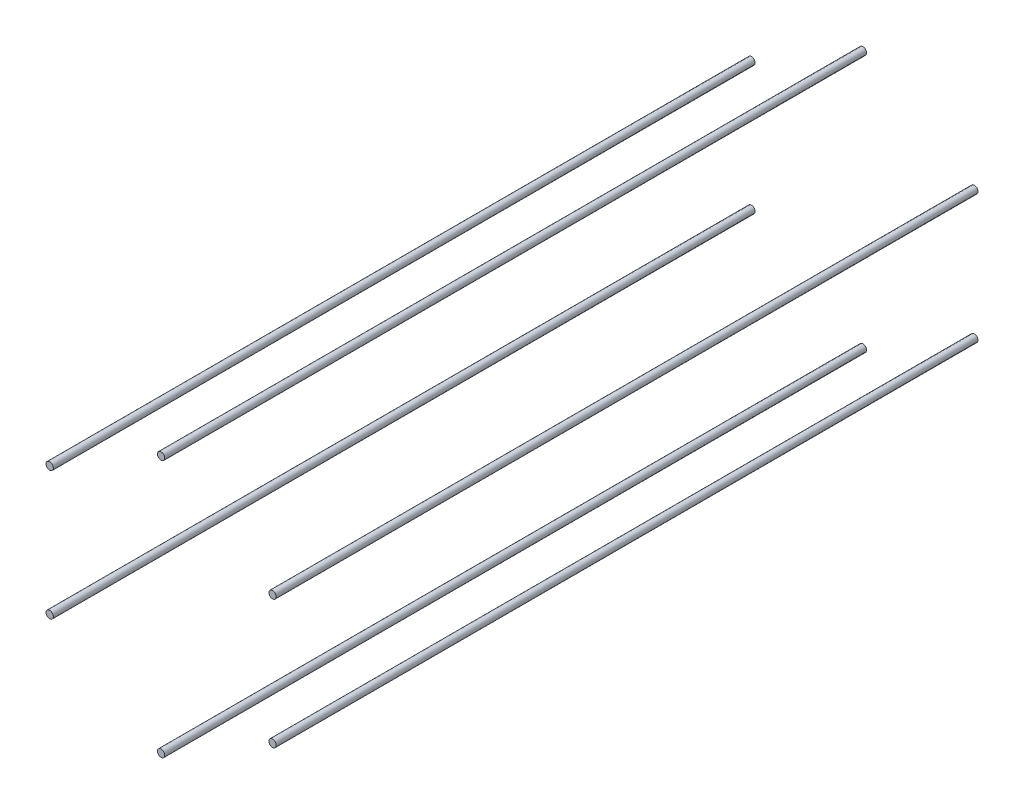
ISO-10303-21;
HEADER;
FILE_DESCRIPTION(('STEP AP214'),'2;1');
FILE_NAME('part.step','',(''),(''),'','','');
FILE_SCHEMA(('AUTOMOTIVE_DESIGN { 1 0 10303 214 1 1 1 1 }'));
ENDSEC;
DATA;
#1=APPLICATION_CONTEXT('core data for automotive mechanical design processes');
#2=APPLICATION_PROTOCOL_DEFINITION('international standard','automotive_design',2000,#1);
#3=PRODUCT_CONTEXT('',#1,'mechanical');
#4=PRODUCT('Part','Part','',(#3));
#5=PRODUCT_RELATED_PRODUCT_CATEGORY('part','',(#4));
#6=PRODUCT_DEFINITION_FORMATION('','',#4);
#7=PRODUCT_DEFINITION_CONTEXT('part definition',#1,'design');
#8=PRODUCT_DEFINITION('design','',#6,#7);
#9=PRODUCT_DEFINITION_SHAPE('','',#8);
#10=(LENGTH_UNIT() NAMED_UNIT(*) SI_UNIT(.MILLI.,.METRE.));
#11=(NAMED_UNIT(*) PLANE_ANGLE_UNIT() SI_UNIT($,.RADIAN.));
#12=(NAMED_UNIT(*) SI_UNIT($,.STERADIAN.) SOLID_ANGLE_UNIT());
#13=UNCERTAINTY_MEASURE_WITH_UNIT(LENGTH_MEASURE(1.E-05),#10,'distance_accuracy_value','');
#14=(GEOMETRIC_REPRESENTATION_CONTEXT(3) GLOBAL_UNCERTAINTY_ASSIGNED_CONTEXT((#13)) GLOBAL_UNIT_ASSIGNED_CONTEXT((#10,
#11,#12)) REPRESENTATION_CONTEXT('',''));
#15=CARTESIAN_POINT('',(0.,0.,0.));
#16=DIRECTION('',(0.,0.,1.));
#17=DIRECTION('',(1.,0.,0.));
#18=AXIS2_PLACEMENT_3D('',#15,#16,#17);
#19=CARTESIAN_POINT('',(-193.581536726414,111.764352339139,609.6));
#20=DIRECTION('',(0.,0.,-1.));
#21=DIRECTION('',(-1.,0.,0.));
#22=AXIS2_PLACEMENT_3D('',#19,#20,#21);
#23=CYLINDRICAL_SURFACE('',#22,6.34999999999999);
#24=CARTESIAN_POINT('',(-193.581536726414,111.764352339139,609.6));
#25=DIRECTION('',(0.,0.,1.));
#26=DIRECTION('',(1.,0.,0.));
#27=AXIS2_PLACEMENT_3D('',#24,#25,#26);
#28=CIRCLE('',#27,6.34999999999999);
#29=CARTESIAN_POINT('',(-199.931536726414,111.764352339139,609.6));
#30=VERTEX_POINT('',#29);
#31=EDGE_CURVE('E58',#30,#30,#28,.T.);
#32=CARTESIAN_POINT('',(-193.581536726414,111.764352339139,-609.6));
#33=DIRECTION('',(0.,0.,1.));
#34=DIRECTION('',(1.,0.,0.));
#35=AXIS2_PLACEMENT_3D('',#32,#33,#34);
#36=CIRCLE('',#35,6.34999999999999);
#37=CARTESIAN_POINT('',(-199.931536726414,111.764352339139,-609.6));
#38=VERTEX_POINT('',#37);
#39=EDGE_CURVE('E11',#38,#38,#36,.T.);
#40=CARTESIAN_POINT('',(-199.931536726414,111.764352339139,609.6));
#41=CARTESIAN_POINT('',(-199.931536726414,111.764352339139,596.9));
#42=CARTESIAN_POINT('',(-199.931536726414,111.764352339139,584.2));
#43=CARTESIAN_POINT('',(-199.931536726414,111.764352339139,558.8));
#44=CARTESIAN_POINT('',(-199.931536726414,111.764352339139,546.1));
#45=CARTESIAN_POINT('',(-199.931536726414,111.764352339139,520.7));
#46=CARTESIAN_POINT('',(-199.931536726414,111.764352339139,508.));
#47=CARTESIAN_POINT('',(-199.931536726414,111.764352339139,482.6));
#48=CARTESIAN_POINT('',(-199.931536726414,111.764352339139,469.9));
#49=CARTESIAN_POINT('',(-199.931536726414,111.764352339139,444.5));
#50=CARTESIAN_POINT('',(-199.931536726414,111.764352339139,431.8));
#51=CARTESIAN_POINT('',(-199.931536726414,111.764352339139,406.4));
#52=CARTESIAN_POINT('',(-199.931536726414,111.764352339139,393.7));
#53=CARTESIAN_POINT('',(-199.931536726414,111.764352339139,368.3));
#54=CARTESIAN_POINT('',(-199.931536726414,111.764352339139,355.6));
#55=CARTESIAN_POINT('',(-199.931536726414,111.764352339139,330.2));
#56=CARTESIAN_POINT('',(-199.931536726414,111.764352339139,317.5));
#57=CARTESIAN_POINT('',(-199.931536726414,111.764352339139,292.1));
#58=CARTESIAN_POINT('',(-199.931536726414,111.764352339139,279.4));
#59=CARTESIAN_POINT('',(-199.931536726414,111.764352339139,254.));
#60=CARTESIAN_POINT('',(-199.931536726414,111.764352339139,241.3));
#61=CARTESIAN_POINT('',(-199.931536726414,111.764352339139,215.9));
#62=CARTESIAN_POINT('',(-199.931536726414,111.764352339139,203.2));
#63=CARTESIAN_POINT('',(-199.931536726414,111.764352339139,177.8));
#64=CARTESIAN_POINT('',(-199.931536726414,111.764352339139,165.1));
#65=CARTESIAN_POINT('',(-199.931536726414,111.764352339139,139.7));
#66=CARTESIAN_POINT('',(-199.931536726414,111.764352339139,127.));
#67=CARTESIAN_POINT('',(-199.931536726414,111.764352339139,101.6));
#68=CARTESIAN_POINT('',(-199.931536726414,111.764352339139,88.9));
#69=CARTESIAN_POINT('',(-199.931536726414,111.764352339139,63.5));
#70=CARTESIAN_POINT('',(-199.931536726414,111.764352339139,50.8));
#71=CARTESIAN_POINT('',(-199.931536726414,111.764352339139,25.4));
#72=CARTESIAN_POINT('',(-199.931536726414,111.764352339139,12.7));
#73=CARTESIAN_POINT('',(-199.931536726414,111.764352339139,-12.7));
#74=CARTESIAN_POINT('',(-199.931536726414,111.764352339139,-25.4));
#75=CARTESIAN_POINT('',(-199.931536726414,111.764352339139,-50.8));
#76=CARTESIAN_POINT('',(-199.931536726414,111.764352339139,-63.5));
#77=CARTESIAN_POINT('',(-199.931536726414,111.764352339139,-88.9));
#78=CARTESIAN_POINT('',(-199.931536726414,111.764352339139,-101.6));
#79=CARTESIAN_POINT('',(-199.931536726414,111.764352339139,-127.));
#80=CARTESIAN_POINT('',(-199.931536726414,111.764352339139,-139.7));
#81=CARTESIAN_POINT('',(-199.931536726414,111.764352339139,-165.1));
#82=CARTESIAN_POINT('',(-199.931536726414,111.764352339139,-177.8));
#83=CARTESIAN_POINT('',(-199.931536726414,111.764352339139,-203.2));
#84=CARTESIAN_POINT('',(-199.931536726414,111.764352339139,-215.9));
#85=CARTESIAN_POINT('',(-199.931536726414,111.764352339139,-241.3));
#86=CARTESIAN_POINT('',(-199.931536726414,111.764352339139,-254.));
#87=CARTESIAN_POINT('',(-199.931536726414,111.764352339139,-279.4));
#88=CARTESIAN_POINT('',(-199.931536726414,111.764352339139,-292.1));
#89=CARTESIAN_POINT('',(-199.931536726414,111.764352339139,-317.5));
#90=CARTESIAN_POINT('',(-199.931536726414,111.764352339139,-330.2));
#91=CARTESIAN_POINT('',(-199.931536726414,111.764352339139,-355.6));
#92=CARTESIAN_POINT('',(-199.931536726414,111.764352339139,-368.3));
#93=CARTESIAN_POINT('',(-199.931536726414,111.764352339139,-393.7));
#94=CARTESIAN_POINT('',(-199.931536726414,111.764352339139,-406.4));
#95=CARTESIAN_POINT('',(-199.931536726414,111.764352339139,-431.8));
#96=CARTESIAN_POINT('',(-199.931536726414,111.764352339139,-444.5));
#97=CARTESIAN_POINT('',(-199.931536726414,111.764352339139,-469.9));
#98=CARTESIAN_POINT('',(-199.931536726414,111.764352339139,-482.6));
#99=CARTESIAN_POINT('',(-199.931536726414,111.764352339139,-508.));
#100=CARTESIAN_POINT('',(-199.931536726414,111.764352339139,-520.7));
#101=CARTESIAN_POINT('',(-199.931536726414,111.764352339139,-546.1));
#102=CARTESIAN_POINT('',(-199.931536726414,111.764352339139,-558.8));
#103=CARTESIAN_POINT('',(-199.931536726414,111.764352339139,-584.2));
#104=CARTESIAN_POINT('',(-199.931536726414,111.764352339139,-596.9));
#105=CARTESIAN_POINT('',(-199.931536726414,111.764352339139,-609.6));
#106=B_SPLINE_CURVE_WITH_KNOTS('',3,(#40,#41,#42,#43,#44,#45,#46,#47,#48,#49,#50,#51,#52,#53,
#54,#55,#56,#57,#58,#59,#60,#61,#62,#63,#64,#65,#66,#67,#68,#69,#70,#71,#72,#73,#74,#75,#76,#77,
#78,#79,#80,#81,#82,#83,#84,#85,#86,#87,#88,#89,#90,#91,#92,#93,#94,#95,#96,#97,#98,#99,#100,
#101,#102,#103,#104,#105),.UNSPECIFIED.,.F.,.F.,(4,2,2,2,2,2,2,2,2,2,2,2,2,2,2,2,2,2,2,2,2,2,2,
2,2,2,2,2,2,2,2,2,4),(0.,38.1,76.2,114.3,152.4,190.5,228.6,266.7,304.8,342.9,381.,419.1,457.2,
495.3,533.4,571.5,609.6,647.7,685.8,723.9,762.,800.1,838.2,876.3,914.4,952.5,990.6,1028.7,
1066.8,1104.9,1143.,1181.1,1219.2),.UNSPECIFIED.);
#107=EDGE_CURVE('BSEAM54',#30,#38,#106,.T.);
#108=ORIENTED_EDGE('',*,*,#31,.F.);
#109=ORIENTED_EDGE('',*,*,#39,.T.);
#110=ORIENTED_EDGE('',*,*,#107,.T.);
#111=ORIENTED_EDGE('',*,*,#107,.F.);
#112=EDGE_LOOP('',(#108,#110,#109,#111));
#113=FACE_BOUND('',#112,.T.);
#114=ADVANCED_FACE('F54',(#113),#23,.T.);
#115=CARTESIAN_POINT('',(-193.581536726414,111.764352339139,609.6));
#116=DIRECTION('',(0.,0.,1.));
#117=DIRECTION('',(1.,0.,0.));
#118=AXIS2_PLACEMENT_3D('',#115,#116,#117);
#119=PLANE('',#118);
#120=ORIENTED_EDGE('',*,*,#31,.T.);
#121=EDGE_LOOP('',(#120));
#122=FACE_BOUND('',#121,.T.);
#123=ADVANCED_FACE('F56',(#122),#119,.T.);
#124=CARTESIAN_POINT('',(-193.581536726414,111.764352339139,-609.6));
#125=DIRECTION('',(0.,0.,1.));
#126=DIRECTION('',(1.,0.,0.));
#127=AXIS2_PLACEMENT_3D('',#124,#125,#126);
#128=PLANE('',#127);
#129=ORIENTED_EDGE('',*,*,#39,.F.);
#130=EDGE_LOOP('',(#129));
#131=FACE_BOUND('',#130,.T.);
#132=ADVANCED_FACE('F73',(#131),#128,.F.);
#133=CLOSED_SHELL('',(#114,#123,#132));
#134=MANIFOLD_SOLID_BREP('B2',#133);
#135=CARTESIAN_POINT('',(-193.581536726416,-111.764352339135,609.6));
#136=DIRECTION('',(0.,0.,-1.));
#137=DIRECTION('',(-1.,0.,0.));
#138=AXIS2_PLACEMENT_3D('',#135,#136,#137);
#139=CYLINDRICAL_SURFACE('',#138,6.35);
#140=CARTESIAN_POINT('',(-193.581536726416,-111.764352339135,609.6));
#141=DIRECTION('',(0.,0.,1.));
#142=DIRECTION('',(1.,0.,0.));
#143=AXIS2_PLACEMENT_3D('',#140,#141,#142);
#144=CIRCLE('',#143,6.35);
#145=CARTESIAN_POINT('',(-199.931536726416,-111.764352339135,609.6));
#146=VERTEX_POINT('',#145);
#147=EDGE_CURVE('E107',#146,#146,#144,.T.);
#148=CARTESIAN_POINT('',(-193.581536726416,-111.764352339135,-609.6));
#149=DIRECTION('',(0.,0.,1.));
#150=DIRECTION('',(1.,0.,0.));
#151=AXIS2_PLACEMENT_3D('',#148,#149,#150);
#152=CIRCLE('',#151,6.35);
#153=CARTESIAN_POINT('',(-199.931536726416,-111.764352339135,-609.6));
#154=VERTEX_POINT('',#153);
#155=EDGE_CURVE('E53',#154,#154,#152,.T.);
#156=CARTESIAN_POINT('',(-199.931536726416,-111.764352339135,609.6));
#157=CARTESIAN_POINT('',(-199.931536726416,-111.764352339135,596.9));
#158=CARTESIAN_POINT('',(-199.931536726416,-111.764352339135,584.2));
#159=CARTESIAN_POINT('',(-199.931536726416,-111.764352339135,558.8));
#160=CARTESIAN_POINT('',(-199.931536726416,-111.764352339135,546.1));
#161=CARTESIAN_POINT('',(-199.931536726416,-111.764352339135,520.7));
#162=CARTESIAN_POINT('',(-199.931536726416,-111.764352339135,508.));
#163=CARTESIAN_POINT('',(-199.931536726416,-111.764352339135,482.6));
#164=CARTESIAN_POINT('',(-199.931536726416,-111.764352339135,469.9));
#165=CARTESIAN_POINT('',(-199.931536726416,-111.764352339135,444.5));
#166=CARTESIAN_POINT('',(-199.931536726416,-111.764352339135,431.8));
#167=CARTESIAN_POINT('',(-199.931536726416,-111.764352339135,406.4));
#168=CARTESIAN_POINT('',(-199.931536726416,-111.764352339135,393.7));
#169=CARTESIAN_POINT('',(-199.931536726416,-111.764352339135,368.3));
#170=CARTESIAN_POINT('',(-199.931536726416,-111.764352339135,355.6));
#171=CARTESIAN_POINT('',(-199.931536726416,-111.764352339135,330.2));
#172=CARTESIAN_POINT('',(-199.931536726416,-111.764352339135,317.5));
#173=CARTESIAN_POINT('',(-199.931536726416,-111.764352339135,292.1));
#174=CARTESIAN_POINT('',(-199.931536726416,-111.764352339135,279.4));
#175=CARTESIAN_POINT('',(-199.931536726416,-111.764352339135,254.));
#176=CARTESIAN_POINT('',(-199.931536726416,-111.764352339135,241.3));
#177=CARTESIAN_POINT('',(-199.931536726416,-111.764352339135,215.9));
#178=CARTESIAN_POINT('',(-199.931536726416,-111.764352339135,203.2));
#179=CARTESIAN_POINT('',(-199.931536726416,-111.764352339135,177.8));
#180=CARTESIAN_POINT('',(-199.931536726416,-111.764352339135,165.1));
#181=CARTESIAN_POINT('',(-199.931536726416,-111.764352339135,139.7));
#182=CARTESIAN_POINT('',(-199.931536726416,-111.764352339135,127.));
#183=CARTESIAN_POINT('',(-199.931536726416,-111.764352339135,101.6));
#184=CARTESIAN_POINT('',(-199.931536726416,-111.764352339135,88.9));
#185=CARTESIAN_POINT('',(-199.931536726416,-111.764352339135,63.5));
#186=CARTESIAN_POINT('',(-199.931536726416,-111.764352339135,50.8));
#187=CARTESIAN_POINT('',(-199.931536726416,-111.764352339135,25.4));
#188=CARTESIAN_POINT('',(-199.931536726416,-111.764352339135,12.7));
#189=CARTESIAN_POINT('',(-199.931536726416,-111.764352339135,-12.7));
#190=CARTESIAN_POINT('',(-199.931536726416,-111.764352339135,-25.4));
#191=CARTESIAN_POINT('',(-199.931536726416,-111.764352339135,-50.8));
#192=CARTESIAN_POINT('',(-199.931536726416,-111.764352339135,-63.5));
#193=CARTESIAN_POINT('',(-199.931536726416,-111.764352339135,-88.9));
#194=CARTESIAN_POINT('',(-199.931536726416,-111.764352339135,-101.6));
#195=CARTESIAN_POINT('',(-199.931536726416,-111.764352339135,-127.));
#196=CARTESIAN_POINT('',(-199.931536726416,-111.764352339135,-139.7));
#197=CARTESIAN_POINT('',(-199.931536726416,-111.764352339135,-165.1));
#198=CARTESIAN_POINT('',(-199.931536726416,-111.764352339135,-177.8));
#199=CARTESIAN_POINT('',(-199.931536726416,-111.764352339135,-203.2));
#200=CARTESIAN_POINT('',(-199.931536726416,-111.764352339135,-215.9));
#201=CARTESIAN_POINT('',(-199.931536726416,-111.764352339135,-241.3));
#202=CARTESIAN_POINT('',(-199.931536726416,-111.764352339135,-254.));
#203=CARTESIAN_POINT('',(-199.931536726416,-111.764352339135,-279.4));
#204=CARTESIAN_POINT('',(-199.931536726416,-111.764352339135,-292.1));
#205=CARTESIAN_POINT('',(-199.931536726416,-111.764352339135,-317.5));
#206=CARTESIAN_POINT('',(-199.931536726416,-111.764352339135,-330.2));
#207=CARTESIAN_POINT('',(-199.931536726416,-111.764352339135,-355.6));
#208=CARTESIAN_POINT('',(-199.931536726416,-111.764352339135,-368.3));
#209=CARTESIAN_POINT('',(-199.931536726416,-111.764352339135,-393.7));
#210=CARTESIAN_POINT('',(-199.931536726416,-111.764352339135,-406.4));
#211=CARTESIAN_POINT('',(-199.931536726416,-111.764352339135,-431.8));
#212=CARTESIAN_POINT('',(-199.931536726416,-111.764352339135,-444.5));
#213=CARTESIAN_POINT('',(-199.931536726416,-111.764352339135,-469.9));
#214=CARTESIAN_POINT('',(-199.931536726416,-111.764352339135,-482.6));
#215=CARTESIAN_POINT('',(-199.931536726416,-111.764352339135,-508.));
#216=CARTESIAN_POINT('',(-199.931536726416,-111.764352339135,-520.7));
#217=CARTESIAN_POINT('',(-199.931536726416,-111.764352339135,-546.1));
#218=CARTESIAN_POINT('',(-199.931536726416,-111.764352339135,-558.8));
#219=CARTESIAN_POINT('',(-199.931536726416,-111.764352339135,-584.2));
#220=CARTESIAN_POINT('',(-199.931536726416,-111.764352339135,-596.9));
#221=CARTESIAN_POINT('',(-199.931536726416,-111.764352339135,-609.6));
#222=B_SPLINE_CURVE_WITH_KNOTS('',3,(#156,#157,#158,#159,#160,#161,#162,#163,#164,#165,#166,
#167,#168,#169,#170,#171,#172,#173,#174,#175,#176,#177,#178,#179,#180,#181,#182,#183,#184,#185,
#186,#187,#188,#189,#190,#191,#192,#193,#194,#195,#196,#197,#198,#199,#200,#201,#202,#203,#204,
#205,#206,#207,#208,#209,#210,#211,#212,#213,#214,#215,#216,#217,#218,#219,#220,#221),
.UNSPECIFIED.,.F.,.F.,(4,2,2,2,2,2,2,2,2,2,2,2,2,2,2,2,2,2,2,2,2,2,2,2,2,2,2,2,2,2,2,2,4),(0.,
38.1,76.2,114.3,152.4,190.5,228.6,266.7,304.8,342.9,381.,419.1,457.2,495.3,533.4,571.5,609.6,
647.7,685.8,723.9,762.,800.1,838.2,876.3,914.4,952.5,990.6,1028.7,1066.8,1104.9,1143.,1181.1,
1219.2),.UNSPECIFIED.);
#223=EDGE_CURVE('BSEAM103',#146,#154,#222,.T.);
#224=ORIENTED_EDGE('',*,*,#147,.F.);
#225=ORIENTED_EDGE('',*,*,#155,.T.);
#226=ORIENTED_EDGE('',*,*,#223,.T.);
#227=ORIENTED_EDGE('',*,*,#223,.F.);
#228=EDGE_LOOP('',(#224,#226,#225,#227));
#229=FACE_BOUND('',#228,.T.);
#230=ADVANCED_FACE('F103',(#229),#139,.T.);
#231=CARTESIAN_POINT('',(-193.581536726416,-111.764352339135,609.6));
#232=DIRECTION('',(0.,0.,1.));
#233=DIRECTION('',(1.,0.,0.));
#234=AXIS2_PLACEMENT_3D('',#231,#232,#233);
#235=PLANE('',#234);
#236=ORIENTED_EDGE('',*,*,#147,.T.);
#237=EDGE_LOOP('',(#236));
#238=FACE_BOUND('',#237,.T.);
#239=ADVANCED_FACE('F105',(#238),#235,.T.);
#240=CARTESIAN_POINT('',(-193.581536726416,-111.764352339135,-609.6));
#241=DIRECTION('',(0.,0.,1.));
#242=DIRECTION('',(1.,0.,0.));
#243=AXIS2_PLACEMENT_3D('',#240,#241,#242);
#244=PLANE('',#243);
#245=ORIENTED_EDGE('',*,*,#155,.F.);
#246=EDGE_LOOP('',(#245));
#247=FACE_BOUND('',#246,.T.);
#248=ADVANCED_FACE('F122',(#247),#244,.F.);
#249=CLOSED_SHELL('',(#230,#239,#248));
#250=MANIFOLD_SOLID_BREP('B6',#249);
#251=CARTESIAN_POINT('',(-1.56089260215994E-12,-223.528704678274,609.6));
#252=DIRECTION('',(0.,0.,-1.));
#253=DIRECTION('',(-1.,0.,0.));
#254=AXIS2_PLACEMENT_3D('',#251,#252,#253);
#255=CYLINDRICAL_SURFACE('',#254,6.34999999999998);
#256=CARTESIAN_POINT('',(-1.56089260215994E-12,-223.528704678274,609.6));
#257=DIRECTION('',(0.,0.,1.));
#258=DIRECTION('',(1.,0.,0.));
#259=AXIS2_PLACEMENT_3D('',#256,#257,#258);
#260=CIRCLE('',#259,6.34999999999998);
#261=CARTESIAN_POINT('',(-6.35000000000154,-223.528704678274,609.6));
#262=VERTEX_POINT('',#261);
#263=EDGE_CURVE('E156',#262,#262,#260,.T.);
#264=CARTESIAN_POINT('',(-1.56089260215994E-12,-223.528704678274,-609.6));
#265=DIRECTION('',(0.,0.,1.));
#266=DIRECTION('',(1.,0.,0.));
#267=AXIS2_PLACEMENT_3D('',#264,#265,#266);
#268=CIRCLE('',#267,6.34999999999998);
#269=CARTESIAN_POINT('',(-6.35000000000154,-223.528704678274,-609.6));
#270=VERTEX_POINT('',#269);
#271=EDGE_CURVE('E102',#270,#270,#268,.T.);
#272=CARTESIAN_POINT('',(-6.35000000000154,-223.528704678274,609.6));
#273=CARTESIAN_POINT('',(-6.35000000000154,-223.528704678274,596.9));
#274=CARTESIAN_POINT('',(-6.35000000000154,-223.528704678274,584.2));
#275=CARTESIAN_POINT('',(-6.35000000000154,-223.528704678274,558.8));
#276=CARTESIAN_POINT('',(-6.35000000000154,-223.528704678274,546.1));
#277=CARTESIAN_POINT('',(-6.35000000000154,-223.528704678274,520.7));
#278=CARTESIAN_POINT('',(-6.35000000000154,-223.528704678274,508.));
#279=CARTESIAN_POINT('',(-6.35000000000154,-223.528704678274,482.6));
#280=CARTESIAN_POINT('',(-6.35000000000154,-223.528704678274,469.9));
#281=CARTESIAN_POINT('',(-6.35000000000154,-223.528704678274,444.5));
#282=CARTESIAN_POINT('',(-6.35000000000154,-223.528704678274,431.8));
#283=CARTESIAN_POINT('',(-6.35000000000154,-223.528704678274,406.4));
#284=CARTESIAN_POINT('',(-6.35000000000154,-223.528704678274,393.7));
#285=CARTESIAN_POINT('',(-6.35000000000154,-223.528704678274,368.3));
#286=CARTESIAN_POINT('',(-6.35000000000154,-223.528704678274,355.6));
#287=CARTESIAN_POINT('',(-6.35000000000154,-223.528704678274,330.2));
#288=CARTESIAN_POINT('',(-6.35000000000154,-223.528704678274,317.5));
#289=CARTESIAN_POINT('',(-6.35000000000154,-223.528704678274,292.1));
#290=CARTESIAN_POINT('',(-6.35000000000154,-223.528704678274,279.4));
#291=CARTESIAN_POINT('',(-6.35000000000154,-223.528704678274,254.));
#292=CARTESIAN_POINT('',(-6.35000000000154,-223.528704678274,241.3));
#293=CARTESIAN_POINT('',(-6.35000000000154,-223.528704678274,215.9));
#294=CARTESIAN_POINT('',(-6.35000000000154,-223.528704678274,203.2));
#295=CARTESIAN_POINT('',(-6.35000000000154,-223.528704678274,177.8));
#296=CARTESIAN_POINT('',(-6.35000000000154,-223.528704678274,165.1));
#297=CARTESIAN_POINT('',(-6.35000000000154,-223.528704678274,139.7));
#298=CARTESIAN_POINT('',(-6.35000000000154,-223.528704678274,127.));
#299=CARTESIAN_POINT('',(-6.35000000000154,-223.528704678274,101.6));
#300=CARTESIAN_POINT('',(-6.35000000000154,-223.528704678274,88.9));
#301=CARTESIAN_POINT('',(-6.35000000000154,-223.528704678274,63.5));
#302=CARTESIAN_POINT('',(-6.35000000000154,-223.528704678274,50.8));
#303=CARTESIAN_POINT('',(-6.35000000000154,-223.528704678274,25.4));
#304=CARTESIAN_POINT('',(-6.35000000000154,-223.528704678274,12.7));
#305=CARTESIAN_POINT('',(-6.35000000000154,-223.528704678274,-12.7));
#306=CARTESIAN_POINT('',(-6.35000000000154,-223.528704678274,-25.4));
#307=CARTESIAN_POINT('',(-6.35000000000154,-223.528704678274,-50.8));
#308=CARTESIAN_POINT('',(-6.35000000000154,-223.528704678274,-63.5));
#309=CARTESIAN_POINT('',(-6.35000000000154,-223.528704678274,-88.9));
#310=CARTESIAN_POINT('',(-6.35000000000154,-223.528704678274,-101.6));
#311=CARTESIAN_POINT('',(-6.35000000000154,-223.528704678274,-127.));
#312=CARTESIAN_POINT('',(-6.35000000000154,-223.528704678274,-139.7));
#313=CARTESIAN_POINT('',(-6.35000000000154,-223.528704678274,-165.1));
#314=CARTESIAN_POINT('',(-6.35000000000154,-223.528704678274,-177.8));
#315=CARTESIAN_POINT('',(-6.35000000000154,-223.528704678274,-203.2));
#316=CARTESIAN_POINT('',(-6.35000000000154,-223.528704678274,-215.9));
#317=CARTESIAN_POINT('',(-6.35000000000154,-223.528704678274,-241.3));
#318=CARTESIAN_POINT('',(-6.35000000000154,-223.528704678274,-254.));
#319=CARTESIAN_POINT('',(-6.35000000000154,-223.528704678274,-279.4));
#320=CARTESIAN_POINT('',(-6.35000000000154,-223.528704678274,-292.1));
#321=CARTESIAN_POINT('',(-6.35000000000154,-223.528704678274,-317.5));
#322=CARTESIAN_POINT('',(-6.35000000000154,-223.528704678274,-330.2));
#323=CARTESIAN_POINT('',(-6.35000000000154,-223.528704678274,-355.6));
#324=CARTESIAN_POINT('',(-6.35000000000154,-223.528704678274,-368.3));
#325=CARTESIAN_POINT('',(-6.35000000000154,-223.528704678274,-393.7));
#326=CARTESIAN_POINT('',(-6.35000000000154,-223.528704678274,-406.4));
#327=CARTESIAN_POINT('',(-6.35000000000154,-223.528704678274,-431.8));
#328=CARTESIAN_POINT('',(-6.35000000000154,-223.528704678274,-444.5));
#329=CARTESIAN_POINT('',(-6.35000000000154,-223.528704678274,-469.9));
#330=CARTESIAN_POINT('',(-6.35000000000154,-223.528704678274,-482.6));
#331=CARTESIAN_POINT('',(-6.35000000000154,-223.528704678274,-508.));
#332=CARTESIAN_POINT('',(-6.35000000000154,-223.528704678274,-520.7));
#333=CARTESIAN_POINT('',(-6.35000000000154,-223.528704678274,-546.1));
#334=CARTESIAN_POINT('',(-6.35000000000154,-223.528704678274,-558.8));
#335=CARTESIAN_POINT('',(-6.35000000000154,-223.528704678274,-584.2));
#336=CARTESIAN_POINT('',(-6.35000000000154,-223.528704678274,-596.9));
#337=CARTESIAN_POINT('',(-6.35000000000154,-223.528704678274,-609.6));
#338=B_SPLINE_CURVE_WITH_KNOTS('',3,(#272,#273,#274,#275,#276,#277,#278,#279,#280,#281,#282,
#283,#284,#285,#286,#287,#288,#289,#290,#291,#292,#293,#294,#295,#296,#297,#298,#299,#300,#301,
#302,#303,#304,#305,#306,#307,#308,#309,#310,#311,#312,#313,#314,#315,#316,#317,#318,#319,#320,
#321,#322,#323,#324,#325,#326,#327,#328,#329,#330,#331,#332,#333,#334,#335,#336,#337),
.UNSPECIFIED.,.F.,.F.,(4,2,2,2,2,2,2,2,2,2,2,2,2,2,2,2,2,2,2,2,2,2,2,2,2,2,2,2,2,2,2,2,4),(0.,
38.1,76.2,114.3,152.4,190.5,228.6,266.7,304.8,342.9,381.,419.1,457.2,495.3,533.4,571.5,609.6,
647.7,685.8,723.9,762.,800.1,838.2,876.3,914.4,952.5,990.6,1028.7,1066.8,1104.9,1143.,1181.1,
1219.2),.UNSPECIFIED.);
#339=EDGE_CURVE('BSEAM152',#262,#270,#338,.T.);
#340=ORIENTED_EDGE('',*,*,#263,.F.);
#341=ORIENTED_EDGE('',*,*,#271,.T.);
#342=ORIENTED_EDGE('',*,*,#339,.T.);
#343=ORIENTED_EDGE('',*,*,#339,.F.);
#344=EDGE_LOOP('',(#340,#342,#341,#343));
#345=FACE_BOUND('',#344,.T.);
#346=ADVANCED_FACE('F152',(#345),#255,.T.);
#347=CARTESIAN_POINT('',(-1.56089260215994E-12,-223.528704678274,609.6));
#348=DIRECTION('',(0.,0.,1.));
#349=DIRECTION('',(1.,0.,0.));
#350=AXIS2_PLACEMENT_3D('',#347,#348,#349);
#351=PLANE('',#350);
#352=ORIENTED_EDGE('',*,*,#263,.T.);
#353=EDGE_LOOP('',(#352));
#354=FACE_BOUND('',#353,.T.);
#355=ADVANCED_FACE('F154',(#354),#351,.T.);
#356=CARTESIAN_POINT('',(-1.56089260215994E-12,-223.528704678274,-609.6));
#357=DIRECTION('',(0.,0.,1.));
#358=DIRECTION('',(1.,0.,0.));
#359=AXIS2_PLACEMENT_3D('',#356,#357,#358);
#360=PLANE('',#359);
#361=ORIENTED_EDGE('',*,*,#271,.F.);
#362=EDGE_LOOP('',(#361));
#363=FACE_BOUND('',#362,.T.);
#364=ADVANCED_FACE('F171',(#363),#360,.F.);
#365=CLOSED_SHELL('',(#346,#355,#364));
#366=MANIFOLD_SOLID_BREP('B48',#365);
#367=CARTESIAN_POINT('',(193.581536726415,-111.764352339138,609.6));
#368=DIRECTION('',(0.,0.,-1.));
#369=DIRECTION('',(-1.,0.,0.));
#370=AXIS2_PLACEMENT_3D('',#367,#368,#369);
#371=CYLINDRICAL_SURFACE('',#370,6.34999999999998);
#372=CARTESIAN_POINT('',(193.581536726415,-111.764352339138,609.6));
#373=DIRECTION('',(0.,0.,1.));
#374=DIRECTION('',(1.,0.,0.));
#375=AXIS2_PLACEMENT_3D('',#372,#373,#374);
#376=CIRCLE('',#375,6.34999999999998);
#377=CARTESIAN_POINT('',(187.231536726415,-111.764352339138,609.6));
#378=VERTEX_POINT('',#377);
#379=EDGE_CURVE('E205',#378,#378,#376,.T.);
#380=CARTESIAN_POINT('',(193.581536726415,-111.764352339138,-609.6));
#381=DIRECTION('',(0.,0.,1.));
#382=DIRECTION('',(1.,0.,0.));
#383=AXIS2_PLACEMENT_3D('',#380,#381,#382);
#384=CIRCLE('',#383,6.34999999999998);
#385=CARTESIAN_POINT('',(187.231536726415,-111.764352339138,-609.6));
#386=VERTEX_POINT('',#385);
#387=EDGE_CURVE('E151',#386,#386,#384,.T.);
#388=CARTESIAN_POINT('',(187.231536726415,-111.764352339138,609.6));
#389=CARTESIAN_POINT('',(187.231536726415,-111.764352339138,596.9));
#390=CARTESIAN_POINT('',(187.231536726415,-111.764352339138,584.2));
#391=CARTESIAN_POINT('',(187.231536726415,-111.764352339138,558.8));
#392=CARTESIAN_POINT('',(187.231536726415,-111.764352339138,546.1));
#393=CARTESIAN_POINT('',(187.231536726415,-111.764352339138,520.7));
#394=CARTESIAN_POINT('',(187.231536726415,-111.764352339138,508.));
#395=CARTESIAN_POINT('',(187.231536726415,-111.764352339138,482.6));
#396=CARTESIAN_POINT('',(187.231536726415,-111.764352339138,469.9));
#397=CARTESIAN_POINT('',(187.231536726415,-111.764352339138,444.5));
#398=CARTESIAN_POINT('',(187.231536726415,-111.764352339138,431.8));
#399=CARTESIAN_POINT('',(187.231536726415,-111.764352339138,406.4));
#400=CARTESIAN_POINT('',(187.231536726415,-111.764352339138,393.7));
#401=CARTESIAN_POINT('',(187.231536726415,-111.764352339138,368.3));
#402=CARTESIAN_POINT('',(187.231536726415,-111.764352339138,355.6));
#403=CARTESIAN_POINT('',(187.231536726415,-111.764352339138,330.2));
#404=CARTESIAN_POINT('',(187.231536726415,-111.764352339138,317.5));
#405=CARTESIAN_POINT('',(187.231536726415,-111.764352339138,292.1));
#406=CARTESIAN_POINT('',(187.231536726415,-111.764352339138,279.4));
#407=CARTESIAN_POINT('',(187.231536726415,-111.764352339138,254.));
#408=CARTESIAN_POINT('',(187.231536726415,-111.764352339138,241.3));
#409=CARTESIAN_POINT('',(187.231536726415,-111.764352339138,215.9));
#410=CARTESIAN_POINT('',(187.231536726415,-111.764352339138,203.2));
#411=CARTESIAN_POINT('',(187.231536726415,-111.764352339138,177.8));
#412=CARTESIAN_POINT('',(187.231536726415,-111.764352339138,165.1));
#413=CARTESIAN_POINT('',(187.231536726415,-111.764352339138,139.7));
#414=CARTESIAN_POINT('',(187.231536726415,-111.764352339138,127.));
#415=CARTESIAN_POINT('',(187.231536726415,-111.764352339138,101.6));
#416=CARTESIAN_POINT('',(187.231536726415,-111.764352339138,88.9));
#417=CARTESIAN_POINT('',(187.231536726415,-111.764352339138,63.5));
#418=CARTESIAN_POINT('',(187.231536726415,-111.764352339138,50.8));
#419=CARTESIAN_POINT('',(187.231536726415,-111.764352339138,25.4));
#420=CARTESIAN_POINT('',(187.231536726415,-111.764352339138,12.7));
#421=CARTESIAN_POINT('',(187.231536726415,-111.764352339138,-12.7));
#422=CARTESIAN_POINT('',(187.231536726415,-111.764352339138,-25.4));
#423=CARTESIAN_POINT('',(187.231536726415,-111.764352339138,-50.8));
#424=CARTESIAN_POINT('',(187.231536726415,-111.764352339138,-63.5));
#425=CARTESIAN_POINT('',(187.231536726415,-111.764352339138,-88.9));
#426=CARTESIAN_POINT('',(187.231536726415,-111.764352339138,-101.6));
#427=CARTESIAN_POINT('',(187.231536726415,-111.764352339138,-127.));
#428=CARTESIAN_POINT('',(187.231536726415,-111.764352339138,-139.7));
#429=CARTESIAN_POINT('',(187.231536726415,-111.764352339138,-165.1));
#430=CARTESIAN_POINT('',(187.231536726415,-111.764352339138,-177.8));
#431=CARTESIAN_POINT('',(187.231536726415,-111.764352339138,-203.2));
#432=CARTESIAN_POINT('',(187.231536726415,-111.764352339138,-215.9));
#433=CARTESIAN_POINT('',(187.231536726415,-111.764352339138,-241.3));
#434=CARTESIAN_POINT('',(187.231536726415,-111.764352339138,-254.));
#435=CARTESIAN_POINT('',(187.231536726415,-111.764352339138,-279.4));
#436=CARTESIAN_POINT('',(187.231536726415,-111.764352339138,-292.1));
#437=CARTESIAN_POINT('',(187.231536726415,-111.764352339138,-317.5));
#438=CARTESIAN_POINT('',(187.231536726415,-111.764352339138,-330.2));
#439=CARTESIAN_POINT('',(187.231536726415,-111.764352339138,-355.6));
#440=CARTESIAN_POINT('',(187.231536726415,-111.764352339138,-368.3));
#441=CARTESIAN_POINT('',(187.231536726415,-111.764352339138,-393.7));
#442=CARTESIAN_POINT('',(187.231536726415,-111.764352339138,-406.4));
#443=CARTESIAN_POINT('',(187.231536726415,-111.764352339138,-431.8));
#444=CARTESIAN_POINT('',(187.231536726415,-111.764352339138,-444.5));
#445=CARTESIAN_POINT('',(187.231536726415,-111.764352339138,-469.9));
#446=CARTESIAN_POINT('',(187.231536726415,-111.764352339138,-482.6));
#447=CARTESIAN_POINT('',(187.231536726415,-111.764352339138,-508.));
#448=CARTESIAN_POINT('',(187.231536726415,-111.764352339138,-520.7));
#449=CARTESIAN_POINT('',(187.231536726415,-111.764352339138,-546.1));
#450=CARTESIAN_POINT('',(187.231536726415,-111.764352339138,-558.8));
#451=CARTESIAN_POINT('',(187.231536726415,-111.764352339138,-584.2));
#452=CARTESIAN_POINT('',(187.231536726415,-111.764352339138,-596.9));
#453=CARTESIAN_POINT('',(187.231536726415,-111.764352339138,-609.6));
#454=B_SPLINE_CURVE_WITH_KNOTS('',3,(#388,#389,#390,#391,#392,#393,#394,#395,#396,#397,#398,
#399,#400,#401,#402,#403,#404,#405,#406,#407,#408,#409,#410,#411,#412,#413,#414,#415,#416,#417,
#418,#419,#420,#421,#422,#423,#424,#425,#426,#427,#428,#429,#430,#431,#432,#433,#434,#435,#436,
#437,#438,#439,#440,#441,#442,#443,#444,#445,#446,#447,#448,#449,#450,#451,#452,#453),
.UNSPECIFIED.,.F.,.F.,(4,2,2,2,2,2,2,2,2,2,2,2,2,2,2,2,2,2,2,2,2,2,2,2,2,2,2,2,2,2,2,2,4),(0.,
38.1,76.2,114.3,152.4,190.5,228.6,266.7,304.8,342.9,381.,419.1,457.2,495.3,533.4,571.5,609.6,
647.7,685.8,723.9,762.,800.1,838.2,876.3,914.4,952.5,990.6,1028.7,1066.8,1104.9,1143.,1181.1,
1219.2),.UNSPECIFIED.);
#455=EDGE_CURVE('BSEAM201',#378,#386,#454,.T.);
#456=ORIENTED_EDGE('',*,*,#379,.F.);
#457=ORIENTED_EDGE('',*,*,#387,.T.);
#458=ORIENTED_EDGE('',*,*,#455,.T.);
#459=ORIENTED_EDGE('',*,*,#455,.F.);
#460=EDGE_LOOP('',(#456,#458,#457,#459));
#461=FACE_BOUND('',#460,.T.);
#462=ADVANCED_FACE('F201',(#461),#371,.T.);
#463=CARTESIAN_POINT('',(193.581536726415,-111.764352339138,609.6));
#464=DIRECTION('',(0.,0.,1.));
#465=DIRECTION('',(1.,0.,0.));
#466=AXIS2_PLACEMENT_3D('',#463,#464,#465);
#467=PLANE('',#466);
#468=ORIENTED_EDGE('',*,*,#379,.T.);
#469=EDGE_LOOP('',(#468));
#470=FACE_BOUND('',#469,.T.);
#471=ADVANCED_FACE('F203',(#470),#467,.T.);
#472=CARTESIAN_POINT('',(193.581536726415,-111.764352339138,-609.6));
#473=DIRECTION('',(0.,0.,1.));
#474=DIRECTION('',(1.,0.,0.));
#475=AXIS2_PLACEMENT_3D('',#472,#473,#474);
#476=PLANE('',#475);
#477=ORIENTED_EDGE('',*,*,#387,.F.);
#478=EDGE_LOOP('',(#477));
#479=FACE_BOUND('',#478,.T.);
#480=ADVANCED_FACE('F220',(#479),#476,.F.);
#481=CLOSED_SHELL('',(#462,#471,#480));
#482=MANIFOLD_SOLID_BREP('B97',#481);
#483=CARTESIAN_POINT('',(193.581536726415,111.764352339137,609.6));
#484=DIRECTION('',(0.,0.,-1.));
#485=DIRECTION('',(-1.,0.,0.));
#486=AXIS2_PLACEMENT_3D('',#483,#484,#485);
#487=CYLINDRICAL_SURFACE('',#486,6.35);
#488=CARTESIAN_POINT('',(193.581536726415,111.764352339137,609.6));
#489=DIRECTION('',(0.,0.,1.));
#490=DIRECTION('',(1.,0.,0.));
#491=AXIS2_PLACEMENT_3D('',#488,#489,#490);
#492=CIRCLE('',#491,6.35);
#493=CARTESIAN_POINT('',(187.231536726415,111.764352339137,609.6));
#494=VERTEX_POINT('',#493);
#495=EDGE_CURVE('E253',#494,#494,#492,.T.);
#496=CARTESIAN_POINT('',(193.581536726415,111.764352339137,-609.6));
#497=DIRECTION('',(0.,0.,1.));
#498=DIRECTION('',(1.,0.,0.));
#499=AXIS2_PLACEMENT_3D('',#496,#497,#498);
#500=CIRCLE('',#499,6.35);
#501=CARTESIAN_POINT('',(187.231536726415,111.764352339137,-609.6));
#502=VERTEX_POINT('',#501);
#503=EDGE_CURVE('E200',#502,#502,#500,.T.);
#504=CARTESIAN_POINT('',(187.231536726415,111.764352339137,609.6));
#505=CARTESIAN_POINT('',(187.231536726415,111.764352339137,596.9));
#506=CARTESIAN_POINT('',(187.231536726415,111.764352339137,584.2));
#507=CARTESIAN_POINT('',(187.231536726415,111.764352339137,558.8));
#508=CARTESIAN_POINT('',(187.231536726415,111.764352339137,546.1));
#509=CARTESIAN_POINT('',(187.231536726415,111.764352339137,520.7));
#510=CARTESIAN_POINT('',(187.231536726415,111.764352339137,508.));
#511=CARTESIAN_POINT('',(187.231536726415,111.764352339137,482.6));
#512=CARTESIAN_POINT('',(187.231536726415,111.764352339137,469.9));
#513=CARTESIAN_POINT('',(187.231536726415,111.764352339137,444.5));
#514=CARTESIAN_POINT('',(187.231536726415,111.764352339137,431.8));
#515=CARTESIAN_POINT('',(187.231536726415,111.764352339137,406.4));
#516=CARTESIAN_POINT('',(187.231536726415,111.764352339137,393.7));
#517=CARTESIAN_POINT('',(187.231536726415,111.764352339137,368.3));
#518=CARTESIAN_POINT('',(187.231536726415,111.764352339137,355.6));
#519=CARTESIAN_POINT('',(187.231536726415,111.764352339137,330.2));
#520=CARTESIAN_POINT('',(187.231536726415,111.764352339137,317.5));
#521=CARTESIAN_POINT('',(187.231536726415,111.764352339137,292.1));
#522=CARTESIAN_POINT('',(187.231536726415,111.764352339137,279.4));
#523=CARTESIAN_POINT('',(187.231536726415,111.764352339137,254.));
#524=CARTESIAN_POINT('',(187.231536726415,111.764352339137,241.3));
#525=CARTESIAN_POINT('',(187.231536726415,111.764352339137,215.9));
#526=CARTESIAN_POINT('',(187.231536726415,111.764352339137,203.2));
#527=CARTESIAN_POINT('',(187.231536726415,111.764352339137,177.8));
#528=CARTESIAN_POINT('',(187.231536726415,111.764352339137,165.1));
#529=CARTESIAN_POINT('',(187.231536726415,111.764352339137,139.7));
#530=CARTESIAN_POINT('',(187.231536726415,111.764352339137,127.));
#531=CARTESIAN_POINT('',(187.231536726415,111.764352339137,101.6));
#532=CARTESIAN_POINT('',(187.231536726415,111.764352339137,88.9));
#533=CARTESIAN_POINT('',(187.231536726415,111.764352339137,63.5));
#534=CARTESIAN_POINT('',(187.231536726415,111.764352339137,50.8));
#535=CARTESIAN_POINT('',(187.231536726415,111.764352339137,25.4));
#536=CARTESIAN_POINT('',(187.231536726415,111.764352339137,12.7));
#537=CARTESIAN_POINT('',(187.231536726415,111.764352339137,-12.7));
#538=CARTESIAN_POINT('',(187.231536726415,111.764352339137,-25.4));
#539=CARTESIAN_POINT('',(187.231536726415,111.764352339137,-50.8));
#540=CARTESIAN_POINT('',(187.231536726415,111.764352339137,-63.5));
#541=CARTESIAN_POINT('',(187.231536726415,111.764352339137,-88.9));
#542=CARTESIAN_POINT('',(187.231536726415,111.764352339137,-101.6));
#543=CARTESIAN_POINT('',(187.231536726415,111.764352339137,-127.));
#544=CARTESIAN_POINT('',(187.231536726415,111.764352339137,-139.7));
#545=CARTESIAN_POINT('',(187.231536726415,111.764352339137,-165.1));
#546=CARTESIAN_POINT('',(187.231536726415,111.764352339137,-177.8));
#547=CARTESIAN_POINT('',(187.231536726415,111.764352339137,-203.2));
#548=CARTESIAN_POINT('',(187.231536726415,111.764352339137,-215.9));
#549=CARTESIAN_POINT('',(187.231536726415,111.764352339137,-241.3));
#550=CARTESIAN_POINT('',(187.231536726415,111.764352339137,-254.));
#551=CARTESIAN_POINT('',(187.231536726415,111.764352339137,-279.4));
#552=CARTESIAN_POINT('',(187.231536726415,111.764352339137,-292.1));
#553=CARTESIAN_POINT('',(187.231536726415,111.764352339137,-317.5));
#554=CARTESIAN_POINT('',(187.231536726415,111.764352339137,-330.2));
#555=CARTESIAN_POINT('',(187.231536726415,111.764352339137,-355.6));
#556=CARTESIAN_POINT('',(187.231536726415,111.764352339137,-368.3));
#557=CARTESIAN_POINT('',(187.231536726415,111.764352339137,-393.7));
#558=CARTESIAN_POINT('',(187.231536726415,111.764352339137,-406.4));
#559=CARTESIAN_POINT('',(187.231536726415,111.764352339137,-431.8));
#560=CARTESIAN_POINT('',(187.231536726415,111.764352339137,-444.5));
#561=CARTESIAN_POINT('',(187.231536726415,111.764352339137,-469.9));
#562=CARTESIAN_POINT('',(187.231536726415,111.764352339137,-482.6));
#563=CARTESIAN_POINT('',(187.231536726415,111.764352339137,-508.));
#564=CARTESIAN_POINT('',(187.231536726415,111.764352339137,-520.7));
#565=CARTESIAN_POINT('',(187.231536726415,111.764352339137,-546.1));
#566=CARTESIAN_POINT('',(187.231536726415,111.764352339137,-558.8));
#567=CARTESIAN_POINT('',(187.231536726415,111.764352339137,-584.2));
#568=CARTESIAN_POINT('',(187.231536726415,111.764352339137,-596.9));
#569=CARTESIAN_POINT('',(187.231536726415,111.764352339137,-609.6));
#570=B_SPLINE_CURVE_WITH_KNOTS('',3,(#504,#505,#506,#507,#508,#509,#510,#511,#512,#513,#514,
#515,#516,#517,#518,#519,#520,#521,#522,#523,#524,#525,#526,#527,#528,#529,#530,#531,#532,#533,
#534,#535,#536,#537,#538,#539,#540,#541,#542,#543,#544,#545,#546,#547,#548,#549,#550,#551,#552,
#553,#554,#555,#556,#557,#558,#559,#560,#561,#562,#563,#564,#565,#566,#567,#568,#569),
.UNSPECIFIED.,.F.,.F.,(4,2,2,2,2,2,2,2,2,2,2,2,2,2,2,2,2,2,2,2,2,2,2,2,2,2,2,2,2,2,2,2,4),(0.,
38.1,76.2,114.3,152.4,190.5,228.6,266.7,304.8,342.9,381.,419.1,457.2,495.3,533.4,571.5,609.6,
647.7,685.8,723.9,762.,800.1,838.2,876.3,914.4,952.5,990.6,1028.7,1066.8,1104.9,1143.,1181.1,
1219.2),.UNSPECIFIED.);
#571=EDGE_CURVE('BSEAM249',#494,#502,#570,.T.);
#572=ORIENTED_EDGE('',*,*,#495,.F.);
#573=ORIENTED_EDGE('',*,*,#503,.T.);
#574=ORIENTED_EDGE('',*,*,#571,.T.);
#575=ORIENTED_EDGE('',*,*,#571,.F.);
#576=EDGE_LOOP('',(#572,#574,#573,#575));
#577=FACE_BOUND('',#576,.T.);
#578=ADVANCED_FACE('F249',(#577),#487,.T.);
#579=CARTESIAN_POINT('',(193.581536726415,111.764352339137,609.6));
#580=DIRECTION('',(0.,0.,1.));
#581=DIRECTION('',(1.,0.,0.));
#582=AXIS2_PLACEMENT_3D('',#579,#580,#581);
#583=PLANE('',#582);
#584=ORIENTED_EDGE('',*,*,#495,.T.);
#585=EDGE_LOOP('',(#584));
#586=FACE_BOUND('',#585,.T.);
#587=ADVANCED_FACE('F251',(#586),#583,.T.);
#588=CARTESIAN_POINT('',(193.581536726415,111.764352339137,-609.6));
#589=DIRECTION('',(0.,0.,1.));
#590=DIRECTION('',(1.,0.,0.));
#591=AXIS2_PLACEMENT_3D('',#588,#589,#590);
#592=PLANE('',#591);
#593=ORIENTED_EDGE('',*,*,#503,.F.);
#594=EDGE_LOOP('',(#593));
#595=FACE_BOUND('',#594,.T.);
#596=ADVANCED_FACE('F270',(#595),#592,.F.);
#597=CLOSED_SHELL('',(#578,#587,#596));
#598=MANIFOLD_SOLID_BREP('B146',#597);
#599=CARTESIAN_POINT('',(0.,223.528704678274,609.6));
#600=DIRECTION('',(0.,0.,-1.));
#601=DIRECTION('',(-1.,0.,0.));
#602=AXIS2_PLACEMENT_3D('',#599,#600,#601);
#603=CYLINDRICAL_SURFACE('',#602,6.35);
#604=CARTESIAN_POINT('',(0.,223.528704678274,609.6));
#605=DIRECTION('',(0.,0.,1.));
#606=DIRECTION('',(1.,0.,0.));
#607=AXIS2_PLACEMENT_3D('',#604,#605,#606);
#608=CIRCLE('',#607,6.35);
#609=CARTESIAN_POINT('',(-6.35,223.528704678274,609.6));
#610=VERTEX_POINT('',#609);
#611=EDGE_CURVE('E248',#610,#610,#608,.T.);
#612=CARTESIAN_POINT('',(0.,223.528704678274,-609.6));
#613=DIRECTION('',(0.,0.,1.));
#614=DIRECTION('',(1.,0.,0.));
#615=AXIS2_PLACEMENT_3D('',#612,#613,#614);
#616=CIRCLE('',#615,6.35);
#617=CARTESIAN_POINT('',(-6.35,223.528704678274,-609.6));
#618=VERTEX_POINT('',#617);
#619=EDGE_CURVE('E295',#618,#618,#616,.T.);
#620=CARTESIAN_POINT('',(-6.35,223.528704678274,609.6));
#621=CARTESIAN_POINT('',(-6.35,223.528704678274,596.9));
#622=CARTESIAN_POINT('',(-6.35,223.528704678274,584.2));
#623=CARTESIAN_POINT('',(-6.35,223.528704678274,558.8));
#624=CARTESIAN_POINT('',(-6.35,223.528704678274,546.1));
#625=CARTESIAN_POINT('',(-6.35,223.528704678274,520.7));
#626=CARTESIAN_POINT('',(-6.35,223.528704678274,508.));
#627=CARTESIAN_POINT('',(-6.35,223.528704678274,482.6));
#628=CARTESIAN_POINT('',(-6.35,223.528704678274,469.9));
#629=CARTESIAN_POINT('',(-6.35,223.528704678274,444.5));
#630=CARTESIAN_POINT('',(-6.35,223.528704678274,431.8));
#631=CARTESIAN_POINT('',(-6.35,223.528704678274,406.4));
#632=CARTESIAN_POINT('',(-6.35,223.528704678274,393.7));
#633=CARTESIAN_POINT('',(-6.35,223.528704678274,368.3));
#634=CARTESIAN_POINT('',(-6.35,223.528704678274,355.6));
#635=CARTESIAN_POINT('',(-6.35,223.528704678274,330.2));
#636=CARTESIAN_POINT('',(-6.35,223.528704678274,317.5));
#637=CARTESIAN_POINT('',(-6.35,223.528704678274,292.1));
#638=CARTESIAN_POINT('',(-6.35,223.528704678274,279.4));
#639=CARTESIAN_POINT('',(-6.35,223.528704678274,254.));
#640=CARTESIAN_POINT('',(-6.35,223.528704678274,241.3));
#641=CARTESIAN_POINT('',(-6.35,223.528704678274,215.9));
#642=CARTESIAN_POINT('',(-6.35,223.528704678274,203.2));
#643=CARTESIAN_POINT('',(-6.35,223.528704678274,177.8));
#644=CARTESIAN_POINT('',(-6.35,223.528704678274,165.1));
#645=CARTESIAN_POINT('',(-6.35,223.528704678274,139.7));
#646=CARTESIAN_POINT('',(-6.35,223.528704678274,127.));
#647=CARTESIAN_POINT('',(-6.35,223.528704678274,101.6));
#648=CARTESIAN_POINT('',(-6.35,223.528704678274,88.9));
#649=CARTESIAN_POINT('',(-6.35,223.528704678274,63.5));
#650=CARTESIAN_POINT('',(-6.35,223.528704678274,50.8));
#651=CARTESIAN_POINT('',(-6.35,223.528704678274,25.4));
#652=CARTESIAN_POINT('',(-6.35,223.528704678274,12.7));
#653=CARTESIAN_POINT('',(-6.35,223.528704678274,-12.7));
#654=CARTESIAN_POINT('',(-6.35,223.528704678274,-25.4));
#655=CARTESIAN_POINT('',(-6.35,223.528704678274,-50.8));
#656=CARTESIAN_POINT('',(-6.35,223.528704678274,-63.5));
#657=CARTESIAN_POINT('',(-6.35,223.528704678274,-88.9));
#658=CARTESIAN_POINT('',(-6.35,223.528704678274,-101.6));
#659=CARTESIAN_POINT('',(-6.35,223.528704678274,-127.));
#660=CARTESIAN_POINT('',(-6.35,223.528704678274,-139.7));
#661=CARTESIAN_POINT('',(-6.35,223.528704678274,-165.1));
#662=CARTESIAN_POINT('',(-6.35,223.528704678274,-177.8));
#663=CARTESIAN_POINT('',(-6.35,223.528704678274,-203.2));
#664=CARTESIAN_POINT('',(-6.35,223.528704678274,-215.9));
#665=CARTESIAN_POINT('',(-6.35,223.528704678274,-241.3));
#666=CARTESIAN_POINT('',(-6.35,223.528704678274,-254.));
#667=CARTESIAN_POINT('',(-6.35,223.528704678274,-279.4));
#668=CARTESIAN_POINT('',(-6.35,223.528704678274,-292.1));
#669=CARTESIAN_POINT('',(-6.35,223.528704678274,-317.5));
#670=CARTESIAN_POINT('',(-6.35,223.528704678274,-330.2));
#671=CARTESIAN_POINT('',(-6.35,223.528704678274,-355.6));
#672=CARTESIAN_POINT('',(-6.35,223.528704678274,-368.3));
#673=CARTESIAN_POINT('',(-6.35,223.528704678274,-393.7));
#674=CARTESIAN_POINT('',(-6.35,223.528704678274,-406.4));
#675=CARTESIAN_POINT('',(-6.35,223.528704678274,-431.8));
#676=CARTESIAN_POINT('',(-6.35,223.528704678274,-444.5));
#677=CARTESIAN_POINT('',(-6.35,223.528704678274,-469.9));
#678=CARTESIAN_POINT('',(-6.35,223.528704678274,-482.6));
#679=CARTESIAN_POINT('',(-6.35,223.528704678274,-508.));
#680=CARTESIAN_POINT('',(-6.35,223.528704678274,-520.7));
#681=CARTESIAN_POINT('',(-6.35,223.528704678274,-546.1));
#682=CARTESIAN_POINT('',(-6.35,223.528704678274,-558.8));
#683=CARTESIAN_POINT('',(-6.35,223.528704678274,-584.2));
#684=CARTESIAN_POINT('',(-6.35,223.528704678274,-596.9));
#685=CARTESIAN_POINT('',(-6.35,223.528704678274,-609.6));
#686=B_SPLINE_CURVE_WITH_KNOTS('',3,(#620,#621,#622,#623,#624,#625,#626,#627,#628,#629,#630,
#631,#632,#633,#634,#635,#636,#637,#638,#639,#640,#641,#642,#643,#644,#645,#646,#647,#648,#649,
#650,#651,#652,#653,#654,#655,#656,#657,#658,#659,#660,#661,#662,#663,#664,#665,#666,#667,#668,
#669,#670,#671,#672,#673,#674,#675,#676,#677,#678,#679,#680,#681,#682,#683,#684,#685),
.UNSPECIFIED.,.F.,.F.,(4,2,2,2,2,2,2,2,2,2,2,2,2,2,2,2,2,2,2,2,2,2,2,2,2,2,2,2,2,2,2,2,4),(0.,
38.1,76.2,114.3,152.4,190.5,228.6,266.7,304.8,342.9,381.,419.1,457.2,495.3,533.4,571.5,609.6,
647.7,685.8,723.9,762.,800.1,838.2,876.3,914.4,952.5,990.6,1028.7,1066.8,1104.9,1143.,1181.1,
1219.2),.UNSPECIFIED.);
#687=EDGE_CURVE('BSEAM292',#610,#618,#686,.T.);
#688=ORIENTED_EDGE('',*,*,#611,.F.);
#689=ORIENTED_EDGE('',*,*,#619,.T.);
#690=ORIENTED_EDGE('',*,*,#687,.T.);
#691=ORIENTED_EDGE('',*,*,#687,.F.);
#692=EDGE_LOOP('',(#688,#690,#689,#691));
#693=FACE_BOUND('',#692,.T.);
#694=ADVANCED_FACE('F292',(#693),#603,.T.);
#695=CARTESIAN_POINT('',(0.,223.528704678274,609.6));
#696=DIRECTION('',(0.,0.,1.));
#697=DIRECTION('',(1.,0.,0.));
#698=AXIS2_PLACEMENT_3D('',#695,#696,#697);
#699=PLANE('',#698);
#700=ORIENTED_EDGE('',*,*,#611,.T.);
#701=EDGE_LOOP('',(#700));
#702=FACE_BOUND('',#701,.T.);
#703=ADVANCED_FACE('F307',(#702),#699,.T.);
#704=CARTESIAN_POINT('',(0.,223.528704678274,-609.6));
#705=DIRECTION('',(0.,0.,1.));
#706=DIRECTION('',(1.,0.,0.));
#707=AXIS2_PLACEMENT_3D('',#704,#705,#706);
#708=PLANE('',#707);
#709=ORIENTED_EDGE('',*,*,#619,.F.);
#710=EDGE_LOOP('',(#709));
#711=FACE_BOUND('',#710,.T.);
#712=ADVANCED_FACE('F305',(#711),#708,.F.);
#713=CLOSED_SHELL('',(#694,#703,#712));
#714=MANIFOLD_SOLID_BREP('B195',#713);
#715=ADVANCED_BREP_SHAPE_REPRESENTATION('',(#18,#134,#250,#366,#482,#598,#714),#14);
#716=SHAPE_DEFINITION_REPRESENTATION(#9,#715);
ENDSEC;
END-ISO-10303-21;
